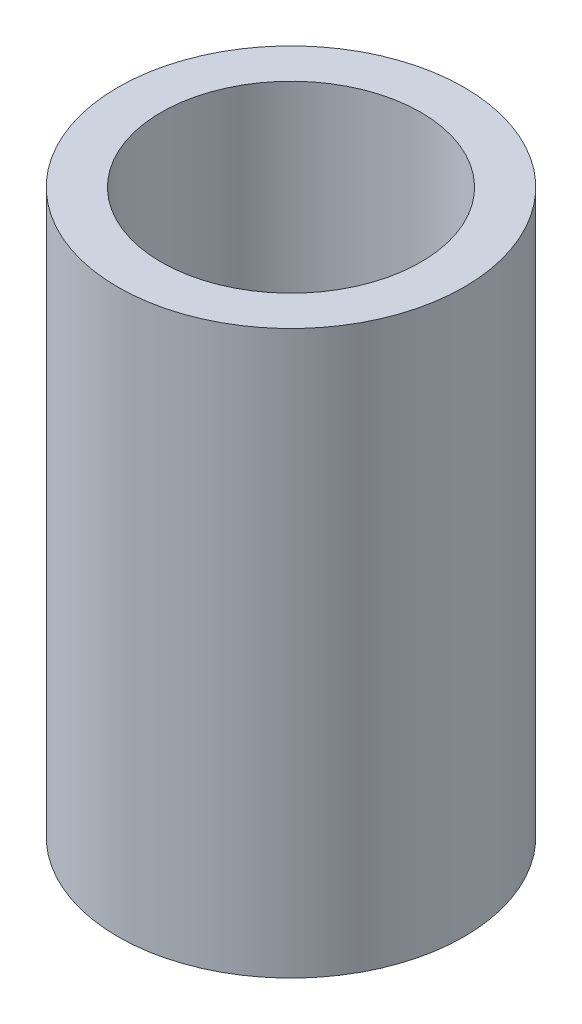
from build123d import *

# Parameters (mm, degrees)
SKETCH_1_R      = 12
SKETCH_1_R_2    = 9
EXTRUDE_1_DEPTH = 19.5


with BuildPart() as part:
    # Sketch 1 → Extrude 1 (new, symmetric)
    with BuildSketch(Plane(origin=(0, 0, 0), x_dir=(1, 0, 0), z_dir=(0, 1, 0))):
        with Locations(Location((0, 0, 0), (0, 0, 270))):
            Circle(SKETCH_1_R)
        with Locations(Location((0, 0, 0), (0, 0, 270))):
            Circle(SKETCH_1_R_2, mode=Mode.SUBTRACT)
    extrude(amount=EXTRUDE_1_DEPTH, both=True)


solid = part.part
